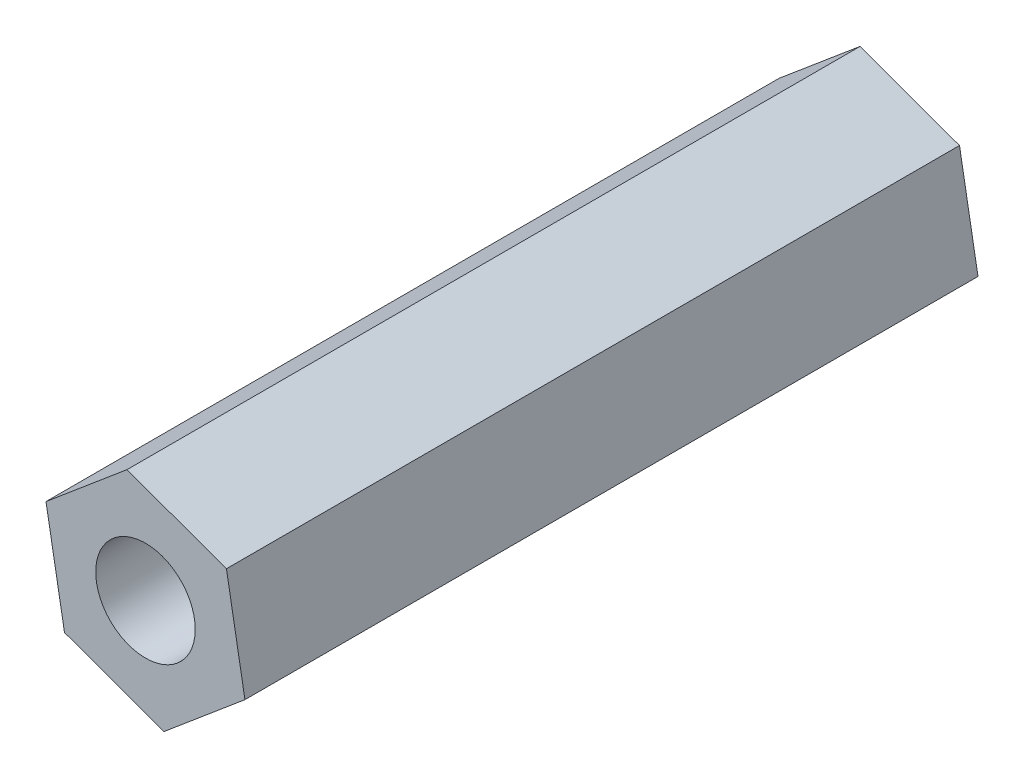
ISO-10303-21;
HEADER;
FILE_DESCRIPTION(('STEP AP214'),'2;1');
FILE_NAME('part.step','',(''),(''),'','','');
FILE_SCHEMA(('AUTOMOTIVE_DESIGN { 1 0 10303 214 1 1 1 1 }'));
ENDSEC;
DATA;
#1=APPLICATION_CONTEXT('core data for automotive mechanical design processes');
#2=APPLICATION_PROTOCOL_DEFINITION('international standard','automotive_design',2000,#1);
#3=PRODUCT_CONTEXT('',#1,'mechanical');
#4=PRODUCT('Part','Part','',(#3));
#5=PRODUCT_RELATED_PRODUCT_CATEGORY('part','',(#4));
#6=PRODUCT_DEFINITION_FORMATION('','',#4);
#7=PRODUCT_DEFINITION_CONTEXT('part definition',#1,'design');
#8=PRODUCT_DEFINITION('design','',#6,#7);
#9=PRODUCT_DEFINITION_SHAPE('','',#8);
#10=(LENGTH_UNIT() NAMED_UNIT(*) SI_UNIT(.MILLI.,.METRE.));
#11=(NAMED_UNIT(*) PLANE_ANGLE_UNIT() SI_UNIT($,.RADIAN.));
#12=(NAMED_UNIT(*) SI_UNIT($,.STERADIAN.) SOLID_ANGLE_UNIT());
#13=UNCERTAINTY_MEASURE_WITH_UNIT(LENGTH_MEASURE(1.E-05),#10,'distance_accuracy_value','');
#14=(GEOMETRIC_REPRESENTATION_CONTEXT(3) GLOBAL_UNCERTAINTY_ASSIGNED_CONTEXT((#13)) GLOBAL_UNIT_ASSIGNED_CONTEXT((#10,
#11,#12)) REPRESENTATION_CONTEXT('',''));
#15=CARTESIAN_POINT('',(0.,0.,0.));
#16=DIRECTION('',(0.,0.,1.));
#17=DIRECTION('',(1.,0.,0.));
#18=AXIS2_PLACEMENT_3D('',#15,#16,#17);
#19=CARTESIAN_POINT('',(0.640676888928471,-3.60975988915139,25.4));
#20=DIRECTION('',(-0.643647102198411,0.765322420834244,0.));
#21=DIRECTION('',(-0.765322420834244,-0.643647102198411,0.));
#22=AXIS2_PLACEMENT_3D('',#19,#20,#21);
#23=PLANE('',#22);
#24=DIRECTION('',(0.765322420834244,0.643647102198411,0.));
#25=VECTOR('',#24,1.);
#26=CARTESIAN_POINT('',(0.640676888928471,-3.60975988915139,0.));
#27=LINE('',#26,#25);
#28=CARTESIAN_POINT('',(0.640676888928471,-3.60975988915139,0.));
#29=VERTEX_POINT('',#28);
#30=CARTESIAN_POINT('',(3.44648221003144,-1.25003748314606,0.));
#31=VERTEX_POINT('',#30);
#32=EDGE_CURVE('E116',#29,#31,#27,.T.);
#33=ORIENTED_EDGE('',*,*,#32,.T.);
#34=DIRECTION('',(0.,0.,-1.));
#35=VECTOR('',#34,1.);
#36=CARTESIAN_POINT('',(3.44648221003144,-1.25003748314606,25.4));
#37=LINE('',#36,#35);
#38=CARTESIAN_POINT('',(3.44648221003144,-1.25003748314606,25.4));
#39=VERTEX_POINT('',#38);
#40=EDGE_CURVE('E11',#39,#31,#37,.T.);
#41=ORIENTED_EDGE('',*,*,#40,.F.);
#42=DIRECTION('',(0.765322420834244,0.643647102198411,0.));
#43=VECTOR('',#42,1.);
#44=CARTESIAN_POINT('',(0.640676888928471,-3.60975988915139,25.4));
#45=LINE('',#44,#43);
#46=CARTESIAN_POINT('',(0.640676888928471,-3.60975988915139,25.4));
#47=VERTEX_POINT('',#46);
#48=EDGE_CURVE('E127',#47,#39,#45,.T.);
#49=ORIENTED_EDGE('',*,*,#48,.F.);
#50=DIRECTION('',(0.,0.,-1.));
#51=VECTOR('',#50,1.);
#52=CARTESIAN_POINT('',(0.640676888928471,-3.60975988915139,25.4));
#53=LINE('',#52,#51);
#54=EDGE_CURVE('E112',#47,#29,#53,.T.);
#55=ORIENTED_EDGE('',*,*,#54,.T.);
#56=EDGE_LOOP('',(#33,#41,#49,#55));
#57=FACE_BOUND('',#56,.T.);
#58=ADVANCED_FACE('F32',(#57),#23,.F.);
#59=CARTESIAN_POINT('',(3.44648221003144,-1.25003748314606,25.4));
#60=DIRECTION('',(-0.984612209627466,-0.174753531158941,0.));
#61=DIRECTION('',(0.174753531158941,-0.984612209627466,0.));
#62=AXIS2_PLACEMENT_3D('',#59,#60,#61);
#63=PLANE('',#62);
#64=DIRECTION('',(-0.174753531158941,0.984612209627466,0.));
#65=VECTOR('',#64,1.);
#66=CARTESIAN_POINT('',(3.44648221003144,-1.25003748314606,0.));
#67=LINE('',#66,#65);
#68=CARTESIAN_POINT('',(2.80580532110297,2.35972240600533,0.));
#69=VERTEX_POINT('',#68);
#70=EDGE_CURVE('E119',#31,#69,#67,.T.);
#71=ORIENTED_EDGE('',*,*,#70,.T.);
#72=DIRECTION('',(0.,0.,-1.));
#73=VECTOR('',#72,1.);
#74=CARTESIAN_POINT('',(2.80580532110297,2.35972240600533,25.4));
#75=LINE('',#74,#73);
#76=CARTESIAN_POINT('',(2.80580532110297,2.35972240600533,25.4));
#77=VERTEX_POINT('',#76);
#78=EDGE_CURVE('E40',#77,#69,#75,.T.);
#79=ORIENTED_EDGE('',*,*,#78,.F.);
#80=DIRECTION('',(-0.174753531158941,0.984612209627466,0.));
#81=VECTOR('',#80,1.);
#82=CARTESIAN_POINT('',(3.44648221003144,-1.25003748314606,25.4));
#83=LINE('',#82,#81);
#84=EDGE_CURVE('E85',#39,#77,#83,.T.);
#85=ORIENTED_EDGE('',*,*,#84,.F.);
#86=ORIENTED_EDGE('',*,*,#40,.T.);
#87=EDGE_LOOP('',(#71,#79,#85,#86));
#88=FACE_BOUND('',#87,.T.);
#89=ADVANCED_FACE('F152',(#88),#63,.F.);
#90=CARTESIAN_POINT('',(2.80580532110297,2.35972240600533,25.4));
#91=DIRECTION('',(-0.340965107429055,-0.940075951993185,0.));
#92=DIRECTION('',(0.940075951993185,-0.340965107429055,0.));
#93=AXIS2_PLACEMENT_3D('',#90,#91,#92);
#94=PLANE('',#93);
#95=DIRECTION('',(-0.940075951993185,0.340965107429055,0.));
#96=VECTOR('',#95,1.);
#97=CARTESIAN_POINT('',(2.80580532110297,2.35972240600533,0.));
#98=LINE('',#97,#96);
#99=CARTESIAN_POINT('',(-0.64067688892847,3.60975988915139,0.));
#100=VERTEX_POINT('',#99);
#101=EDGE_CURVE('E122',#69,#100,#98,.T.);
#102=ORIENTED_EDGE('',*,*,#101,.T.);
#103=DIRECTION('',(0.,0.,-1.));
#104=VECTOR('',#103,1.);
#105=CARTESIAN_POINT('',(-0.64067688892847,3.60975988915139,25.4));
#106=LINE('',#105,#104);
#107=CARTESIAN_POINT('',(-0.64067688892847,3.60975988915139,25.4));
#108=VERTEX_POINT('',#107);
#109=EDGE_CURVE('E107',#108,#100,#106,.T.);
#110=ORIENTED_EDGE('',*,*,#109,.F.);
#111=DIRECTION('',(-0.940075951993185,0.340965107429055,0.));
#112=VECTOR('',#111,1.);
#113=CARTESIAN_POINT('',(2.80580532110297,2.35972240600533,25.4));
#114=LINE('',#113,#112);
#115=EDGE_CURVE('E98',#77,#108,#114,.T.);
#116=ORIENTED_EDGE('',*,*,#115,.F.);
#117=ORIENTED_EDGE('',*,*,#78,.T.);
#118=EDGE_LOOP('',(#102,#110,#116,#117));
#119=FACE_BOUND('',#118,.T.);
#120=ADVANCED_FACE('F133',(#119),#94,.F.);
#121=CARTESIAN_POINT('',(-0.64067688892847,3.60975988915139,25.4));
#122=DIRECTION('',(0.643647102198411,-0.765322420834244,0.));
#123=DIRECTION('',(0.765322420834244,0.643647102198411,0.));
#124=AXIS2_PLACEMENT_3D('',#121,#122,#123);
#125=PLANE('',#124);
#126=DIRECTION('',(-0.765322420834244,-0.643647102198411,0.));
#127=VECTOR('',#126,1.);
#128=CARTESIAN_POINT('',(-0.64067688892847,3.60975988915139,0.));
#129=LINE('',#128,#127);
#130=CARTESIAN_POINT('',(-3.44648221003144,1.25003748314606,0.));
#131=VERTEX_POINT('',#130);
#132=EDGE_CURVE('E106',#100,#131,#129,.T.);
#133=ORIENTED_EDGE('',*,*,#132,.T.);
#134=DIRECTION('',(0.,0.,-1.));
#135=VECTOR('',#134,1.);
#136=CARTESIAN_POINT('',(-3.44648221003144,1.25003748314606,25.4));
#137=LINE('',#136,#135);
#138=CARTESIAN_POINT('',(-3.44648221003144,1.25003748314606,25.4));
#139=VERTEX_POINT('',#138);
#140=EDGE_CURVE('E103',#139,#131,#137,.T.);
#141=ORIENTED_EDGE('',*,*,#140,.F.);
#142=DIRECTION('',(-0.765322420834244,-0.643647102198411,0.));
#143=VECTOR('',#142,1.);
#144=CARTESIAN_POINT('',(-0.64067688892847,3.60975988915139,25.4));
#145=LINE('',#144,#143);
#146=EDGE_CURVE('E92',#108,#139,#145,.T.);
#147=ORIENTED_EDGE('',*,*,#146,.F.);
#148=ORIENTED_EDGE('',*,*,#109,.T.);
#149=EDGE_LOOP('',(#133,#141,#147,#148));
#150=FACE_BOUND('',#149,.T.);
#151=ADVANCED_FACE('F104',(#150),#125,.F.);
#152=CARTESIAN_POINT('',(-3.44648221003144,1.25003748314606,25.4));
#153=DIRECTION('',(0.984612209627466,0.174753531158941,0.));
#154=DIRECTION('',(-0.174753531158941,0.984612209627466,0.));
#155=AXIS2_PLACEMENT_3D('',#152,#153,#154);
#156=PLANE('',#155);
#157=DIRECTION('',(0.174753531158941,-0.984612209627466,0.));
#158=VECTOR('',#157,1.);
#159=CARTESIAN_POINT('',(-3.44648221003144,1.25003748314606,0.));
#160=LINE('',#159,#158);
#161=CARTESIAN_POINT('',(-2.80580532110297,-2.35972240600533,0.));
#162=VERTEX_POINT('',#161);
#163=EDGE_CURVE('E71',#131,#162,#160,.T.);
#164=ORIENTED_EDGE('',*,*,#163,.T.);
#165=DIRECTION('',(0.,0.,-1.));
#166=VECTOR('',#165,1.);
#167=CARTESIAN_POINT('',(-2.80580532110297,-2.35972240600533,25.4));
#168=LINE('',#167,#166);
#169=CARTESIAN_POINT('',(-2.80580532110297,-2.35972240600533,25.4));
#170=VERTEX_POINT('',#169);
#171=EDGE_CURVE('E108',#170,#162,#168,.T.);
#172=ORIENTED_EDGE('',*,*,#171,.F.);
#173=DIRECTION('',(0.174753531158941,-0.984612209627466,0.));
#174=VECTOR('',#173,1.);
#175=CARTESIAN_POINT('',(-3.44648221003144,1.25003748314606,25.4));
#176=LINE('',#175,#174);
#177=EDGE_CURVE('E96',#139,#170,#176,.T.);
#178=ORIENTED_EDGE('',*,*,#177,.F.);
#179=ORIENTED_EDGE('',*,*,#140,.T.);
#180=EDGE_LOOP('',(#164,#172,#178,#179));
#181=FACE_BOUND('',#180,.T.);
#182=ADVANCED_FACE('F110',(#181),#156,.F.);
#183=CARTESIAN_POINT('',(-2.80580532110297,-2.35972240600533,25.4));
#184=DIRECTION('',(0.340965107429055,0.940075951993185,0.));
#185=DIRECTION('',(-0.940075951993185,0.340965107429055,0.));
#186=AXIS2_PLACEMENT_3D('',#183,#184,#185);
#187=PLANE('',#186);
#188=DIRECTION('',(0.940075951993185,-0.340965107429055,0.));
#189=VECTOR('',#188,1.);
#190=CARTESIAN_POINT('',(-2.80580532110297,-2.35972240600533,0.));
#191=LINE('',#190,#189);
#192=EDGE_CURVE('E77',#162,#29,#191,.T.);
#193=ORIENTED_EDGE('',*,*,#192,.T.);
#194=ORIENTED_EDGE('',*,*,#54,.F.);
#195=DIRECTION('',(0.940075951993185,-0.340965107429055,0.));
#196=VECTOR('',#195,1.);
#197=CARTESIAN_POINT('',(-2.80580532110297,-2.35972240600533,25.4));
#198=LINE('',#197,#196);
#199=EDGE_CURVE('E48',#170,#47,#198,.T.);
#200=ORIENTED_EDGE('',*,*,#199,.F.);
#201=ORIENTED_EDGE('',*,*,#171,.T.);
#202=EDGE_LOOP('',(#193,#194,#200,#201));
#203=FACE_BOUND('',#202,.T.);
#204=ADVANCED_FACE('F140',(#203),#187,.F.);
#205=CARTESIAN_POINT('',(0.,0.,25.4));
#206=DIRECTION('',(0.,0.,1.));
#207=DIRECTION('',(1.,0.,0.));
#208=AXIS2_PLACEMENT_3D('',#205,#206,#207);
#209=PLANE('',#208);
#210=CARTESIAN_POINT('',(0.,0.,25.4));
#211=DIRECTION('',(0.,0.,1.));
#212=DIRECTION('',(1.,0.,0.));
#213=AXIS2_PLACEMENT_3D('',#210,#211,#212);
#214=CIRCLE('',#213,1.72421426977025);
#215=CARTESIAN_POINT('',(1.72421426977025,0.,25.4));
#216=VERTEX_POINT('',#215);
#217=EDGE_CURVE('E207',#216,#216,#214,.T.);
#218=ORIENTED_EDGE('',*,*,#217,.F.);
#219=EDGE_LOOP('',(#218));
#220=FACE_BOUND('',#219,.T.);
#221=ORIENTED_EDGE('',*,*,#48,.T.);
#222=ORIENTED_EDGE('',*,*,#84,.T.);
#223=ORIENTED_EDGE('',*,*,#115,.T.);
#224=ORIENTED_EDGE('',*,*,#146,.T.);
#225=ORIENTED_EDGE('',*,*,#177,.T.);
#226=ORIENTED_EDGE('',*,*,#199,.T.);
#227=EDGE_LOOP('',(#221,#222,#223,#224,#225,#226));
#228=FACE_BOUND('',#227,.T.);
#229=ADVANCED_FACE('F94',(#220,#228),#209,.T.);
#230=CARTESIAN_POINT('',(0.,0.,0.));
#231=DIRECTION('',(0.,0.,1.));
#232=DIRECTION('',(1.,0.,0.));
#233=AXIS2_PLACEMENT_3D('',#230,#231,#232);
#234=PLANE('',#233);
#235=CARTESIAN_POINT('',(0.,0.,0.));
#236=DIRECTION('',(0.,0.,1.));
#237=DIRECTION('',(1.,0.,0.));
#238=AXIS2_PLACEMENT_3D('',#235,#236,#237);
#239=CIRCLE('',#238,1.72421426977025);
#240=CARTESIAN_POINT('',(1.72421426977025,0.,0.));
#241=VERTEX_POINT('',#240);
#242=EDGE_CURVE('E120',#241,#241,#239,.T.);
#243=ORIENTED_EDGE('',*,*,#242,.T.);
#244=EDGE_LOOP('',(#243));
#245=FACE_BOUND('',#244,.T.);
#246=ORIENTED_EDGE('',*,*,#32,.F.);
#247=ORIENTED_EDGE('',*,*,#192,.F.);
#248=ORIENTED_EDGE('',*,*,#163,.F.);
#249=ORIENTED_EDGE('',*,*,#132,.F.);
#250=ORIENTED_EDGE('',*,*,#101,.F.);
#251=ORIENTED_EDGE('',*,*,#70,.F.);
#252=EDGE_LOOP('',(#246,#247,#248,#249,#250,#251));
#253=FACE_BOUND('',#252,.T.);
#254=ADVANCED_FACE('F136',(#245,#253),#234,.F.);
#255=CARTESIAN_POINT('',(0.,0.,0.));
#256=DIRECTION('',(0.,0.,1.));
#257=DIRECTION('',(1.,0.,0.));
#258=AXIS2_PLACEMENT_3D('',#255,#256,#257);
#259=CYLINDRICAL_SURFACE('',#258,1.72421426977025);
#260=ORIENTED_EDGE('',*,*,#242,.F.);
#261=EDGE_LOOP('',(#260));
#262=FACE_BOUND('',#261,.T.);
#263=ORIENTED_EDGE('',*,*,#217,.T.);
#264=EDGE_LOOP('',(#263));
#265=FACE_BOUND('',#264,.T.);
#266=ADVANCED_FACE('F189',(#262,#265),#259,.F.);
#267=CLOSED_SHELL('',(#58,#89,#120,#151,#182,#204,#229,#254,#266));
#268=MANIFOLD_SOLID_BREP('B2',#267);
#269=ADVANCED_BREP_SHAPE_REPRESENTATION('',(#18,#268),#14);
#270=SHAPE_DEFINITION_REPRESENTATION(#9,#269);
ENDSEC;
END-ISO-10303-21;
